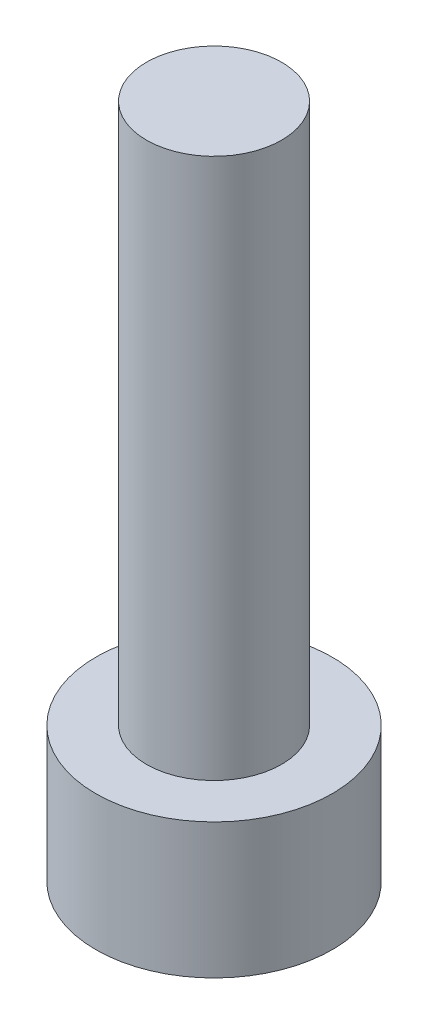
from build123d import *

# Parameters (mm, degrees)
SKETCH_1_R          = 3.5
EXTRUDE_1_DEPTH     = 4
SKETCH_2_R          = 2
EXTRUDE_2_DEPTH     = 16
CUT_EXTRUDE_1_DEPTH = 2


with BuildPart() as part:
    # Sketch 1 → Extrude 1 (new body)
    with BuildSketch(Plane(origin=(0, 0, 0), x_dir=(1, 0, 0), z_dir=(0, 1, 0))):
        with Locations(Location((0, 0, 0), (0, 0, 270))):
            Circle(SKETCH_1_R)
    extrude(amount=EXTRUDE_1_DEPTH)

    # Sketch 2 → Extrude 2 (add)
    with BuildSketch(Plane(origin=(0, 4, 0), x_dir=(1, 0, 0), z_dir=(0, 1, 0))):
        with Locations(Location((0, 0, 0), (0, 0, 270))):
            Circle(SKETCH_2_R)
    extrude(amount=EXTRUDE_2_DEPTH)

    # Sketch 3 → Cut-Extrude 1 (cut)
    with BuildSketch(Plane.XZ):
        Polygon((1.058671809, -1.370844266), (1.716521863, 0.231414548), (0.657850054, 1.602258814), (-1.058671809, 1.370844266), (-1.716521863, -0.231414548), (-0.657850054, -1.602258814), align=None)
    extrude(amount=-CUT_EXTRUDE_1_DEPTH, mode=Mode.SUBTRACT)


solid = part.part
